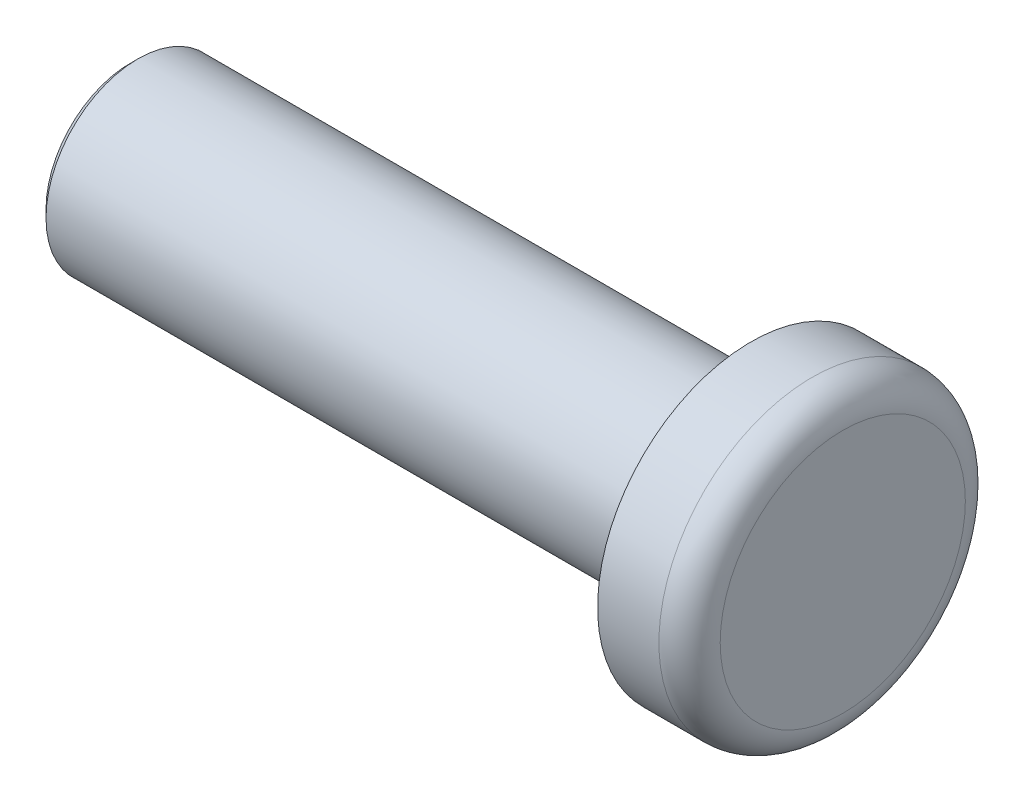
ISO-10303-21;
HEADER;
FILE_DESCRIPTION(('STEP AP214'),'2;1');
FILE_NAME('part.step','',(''),(''),'','','');
FILE_SCHEMA(('AUTOMOTIVE_DESIGN { 1 0 10303 214 1 1 1 1 }'));
ENDSEC;
DATA;
#1=APPLICATION_CONTEXT('core data for automotive mechanical design processes');
#2=APPLICATION_PROTOCOL_DEFINITION('international standard','automotive_design',2000,#1);
#3=PRODUCT_CONTEXT('',#1,'mechanical');
#4=PRODUCT('Part','Part','',(#3));
#5=PRODUCT_RELATED_PRODUCT_CATEGORY('part','',(#4));
#6=PRODUCT_DEFINITION_FORMATION('','',#4);
#7=PRODUCT_DEFINITION_CONTEXT('part definition',#1,'design');
#8=PRODUCT_DEFINITION('design','',#6,#7);
#9=PRODUCT_DEFINITION_SHAPE('','',#8);
#10=(LENGTH_UNIT() NAMED_UNIT(*) SI_UNIT(.MILLI.,.METRE.));
#11=(NAMED_UNIT(*) PLANE_ANGLE_UNIT() SI_UNIT($,.RADIAN.));
#12=(NAMED_UNIT(*) SI_UNIT($,.STERADIAN.) SOLID_ANGLE_UNIT());
#13=UNCERTAINTY_MEASURE_WITH_UNIT(LENGTH_MEASURE(1.E-05),#10,'distance_accuracy_value','');
#14=(GEOMETRIC_REPRESENTATION_CONTEXT(3) GLOBAL_UNCERTAINTY_ASSIGNED_CONTEXT((#13)) GLOBAL_UNIT_ASSIGNED_CONTEXT((#10,
#11,#12)) REPRESENTATION_CONTEXT('',''));
#15=CARTESIAN_POINT('',(0.,0.,0.));
#16=DIRECTION('',(0.,0.,1.));
#17=DIRECTION('',(1.,0.,0.));
#18=AXIS2_PLACEMENT_3D('',#15,#16,#17);
#19=CARTESIAN_POINT('',(0.,0.,0.));
#20=DIRECTION('',(1.,0.,0.));
#21=DIRECTION('',(0.,0.,-1.));
#22=AXIS2_PLACEMENT_3D('',#19,#20,#21);
#23=PLANE('',#22);
#24=CARTESIAN_POINT('',(0.,0.,0.));
#25=DIRECTION('',(1.,0.,0.));
#26=DIRECTION('',(0.,0.,-1.));
#27=AXIS2_PLACEMENT_3D('',#24,#25,#26);
#28=CIRCLE('',#27,3.25000000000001);
#29=CARTESIAN_POINT('',(0.,0.,-3.25000000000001));
#30=VERTEX_POINT('',#29);
#31=EDGE_CURVE('E36',#30,#30,#28,.T.);
#32=ORIENTED_EDGE('',*,*,#31,.T.);
#33=EDGE_LOOP('',(#32));
#34=FACE_BOUND('',#33,.T.);
#35=CARTESIAN_POINT('',(0.,0.,0.));
#36=DIRECTION('',(1.,0.,0.));
#37=DIRECTION('',(0.,0.,-1.));
#38=AXIS2_PLACEMENT_3D('',#35,#36,#37);
#39=CIRCLE('',#38,5.);
#40=CARTESIAN_POINT('',(0.,0.,-5.));
#41=VERTEX_POINT('',#40);
#42=EDGE_CURVE('E55',#41,#41,#39,.T.);
#43=ORIENTED_EDGE('',*,*,#42,.F.);
#44=EDGE_LOOP('',(#43));
#45=FACE_BOUND('',#44,.T.);
#46=ADVANCED_FACE('F29',(#34,#45),#23,.F.);
#47=CARTESIAN_POINT('',(3.,0.,0.));
#48=DIRECTION('',(-1.,0.,0.));
#49=DIRECTION('',(0.,0.,1.));
#50=AXIS2_PLACEMENT_3D('',#47,#48,#49);
#51=CYLINDRICAL_SURFACE('',#50,5.);
#52=CARTESIAN_POINT('',(2.,0.,0.));
#53=DIRECTION('',(1.,0.,0.));
#54=DIRECTION('',(0.,0.,-1.));
#55=AXIS2_PLACEMENT_3D('',#52,#53,#54);
#56=CIRCLE('',#55,5.);
#57=CARTESIAN_POINT('',(2.,0.,-5.));
#58=VERTEX_POINT('',#57);
#59=EDGE_CURVE('E49',#58,#58,#56,.F.);
#60=ORIENTED_EDGE('',*,*,#59,.T.);
#61=EDGE_LOOP('',(#60));
#62=FACE_BOUND('',#61,.T.);
#63=ORIENTED_EDGE('',*,*,#42,.T.);
#64=EDGE_LOOP('',(#63));
#65=FACE_BOUND('',#64,.T.);
#66=ADVANCED_FACE('F59',(#62,#65),#51,.T.);
#67=CARTESIAN_POINT('',(3.,0.,0.));
#68=DIRECTION('',(1.,0.,0.));
#69=DIRECTION('',(0.,0.,-1.));
#70=AXIS2_PLACEMENT_3D('',#67,#68,#69);
#71=PLANE('',#70);
#72=CARTESIAN_POINT('',(3.,0.,0.));
#73=DIRECTION('',(1.,0.,0.));
#74=DIRECTION('',(0.,0.,-1.));
#75=AXIS2_PLACEMENT_3D('',#72,#73,#74);
#76=CIRCLE('',#75,4.);
#77=CARTESIAN_POINT('',(3.,0.,-4.));
#78=VERTEX_POINT('',#77);
#79=EDGE_CURVE('E52',#78,#78,#76,.T.);
#80=ORIENTED_EDGE('',*,*,#79,.T.);
#81=EDGE_LOOP('',(#80));
#82=FACE_BOUND('',#81,.T.);
#83=ADVANCED_FACE('F66',(#82),#71,.T.);
#84=CARTESIAN_POINT('',(-20.25,0.,0.));
#85=DIRECTION('',(1.,0.,0.));
#86=DIRECTION('',(0.,0.,-1.));
#87=AXIS2_PLACEMENT_3D('',#84,#85,#86);
#88=CYLINDRICAL_SURFACE('',#87,3.);
#89=CARTESIAN_POINT('',(-0.250000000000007,0.,0.));
#90=DIRECTION('',(1.,0.,0.));
#91=DIRECTION('',(0.,0.,-1.));
#92=AXIS2_PLACEMENT_3D('',#89,#90,#91);
#93=CIRCLE('',#92,3.);
#94=CARTESIAN_POINT('',(-0.250000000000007,0.,-3.));
#95=VERTEX_POINT('',#94);
#96=EDGE_CURVE('E40',#95,#95,#93,.F.);
#97=ORIENTED_EDGE('',*,*,#96,.T.);
#98=EDGE_LOOP('',(#97));
#99=FACE_BOUND('',#98,.T.);
#100=CARTESIAN_POINT('',(-20.,0.,0.));
#101=DIRECTION('',(-1.,0.,0.));
#102=DIRECTION('',(0.,0.,1.));
#103=AXIS2_PLACEMENT_3D('',#100,#101,#102);
#104=CIRCLE('',#103,3.);
#105=CARTESIAN_POINT('',(-20.,0.,3.));
#106=VERTEX_POINT('',#105);
#107=EDGE_CURVE('E44',#106,#106,#104,.F.);
#108=ORIENTED_EDGE('',*,*,#107,.T.);
#109=EDGE_LOOP('',(#108));
#110=FACE_BOUND('',#109,.T.);
#111=ADVANCED_FACE('F86',(#99,#110),#88,.T.);
#112=CARTESIAN_POINT('',(-20.25,0.,0.));
#113=DIRECTION('',(-1.,0.,0.));
#114=DIRECTION('',(0.,0.,1.));
#115=AXIS2_PLACEMENT_3D('',#112,#113,#114);
#116=PLANE('',#115);
#117=CARTESIAN_POINT('',(-20.25,0.,0.));
#118=DIRECTION('',(-1.,0.,0.));
#119=DIRECTION('',(0.,0.,1.));
#120=AXIS2_PLACEMENT_3D('',#117,#118,#119);
#121=CIRCLE('',#120,2.75);
#122=CARTESIAN_POINT('',(-20.25,0.,2.75));
#123=VERTEX_POINT('',#122);
#124=EDGE_CURVE('E10',#123,#123,#121,.T.);
#125=ORIENTED_EDGE('',*,*,#124,.T.);
#126=EDGE_LOOP('',(#125));
#127=FACE_BOUND('',#126,.T.);
#128=ADVANCED_FACE('F75',(#127),#116,.T.);
#129=CARTESIAN_POINT('',(2.,0.,0.));
#130=DIRECTION('',(1.,0.,0.));
#131=DIRECTION('',(0.,0.,-1.));
#132=AXIS2_PLACEMENT_3D('',#129,#130,#131);
#133=TOROIDAL_SURFACE('',#132,4.,1.);
#134=ORIENTED_EDGE('',*,*,#59,.F.);
#135=EDGE_LOOP('',(#134));
#136=FACE_BOUND('',#135,.T.);
#137=ORIENTED_EDGE('',*,*,#79,.F.);
#138=EDGE_LOOP('',(#137));
#139=FACE_BOUND('',#138,.T.);
#140=ADVANCED_FACE('F72',(#136,#139),#133,.T.);
#141=CARTESIAN_POINT('',(-0.250000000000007,0.,0.));
#142=DIRECTION('',(1.,0.,0.));
#143=DIRECTION('',(0.,0.,-1.));
#144=AXIS2_PLACEMENT_3D('',#141,#142,#143);
#145=CONICAL_SURFACE('',#144,3.,0.785398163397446);
#146=ORIENTED_EDGE('',*,*,#31,.F.);
#147=EDGE_LOOP('',(#146));
#148=FACE_BOUND('',#147,.T.);
#149=ORIENTED_EDGE('',*,*,#96,.F.);
#150=EDGE_LOOP('',(#149));
#151=FACE_BOUND('',#150,.T.);
#152=ADVANCED_FACE('F74',(#148,#151),#145,.T.);
#153=CARTESIAN_POINT('',(-20.25,0.,0.));
#154=DIRECTION('',(1.,0.,0.));
#155=DIRECTION('',(0.,0.,-1.));
#156=AXIS2_PLACEMENT_3D('',#153,#154,#155);
#157=CONICAL_SURFACE('',#156,2.75,0.785398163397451);
#158=ORIENTED_EDGE('',*,*,#107,.F.);
#159=EDGE_LOOP('',(#158));
#160=FACE_BOUND('',#159,.T.);
#161=ORIENTED_EDGE('',*,*,#124,.F.);
#162=EDGE_LOOP('',(#161));
#163=FACE_BOUND('',#162,.T.);
#164=ADVANCED_FACE('F31',(#160,#163),#157,.T.);
#165=CLOSED_SHELL('',(#46,#66,#83,#111,#128,#140,#152,#164));
#166=MANIFOLD_SOLID_BREP('B2',#165);
#167=ADVANCED_BREP_SHAPE_REPRESENTATION('',(#18,#166),#14);
#168=SHAPE_DEFINITION_REPRESENTATION(#9,#167);
ENDSEC;
END-ISO-10303-21;
